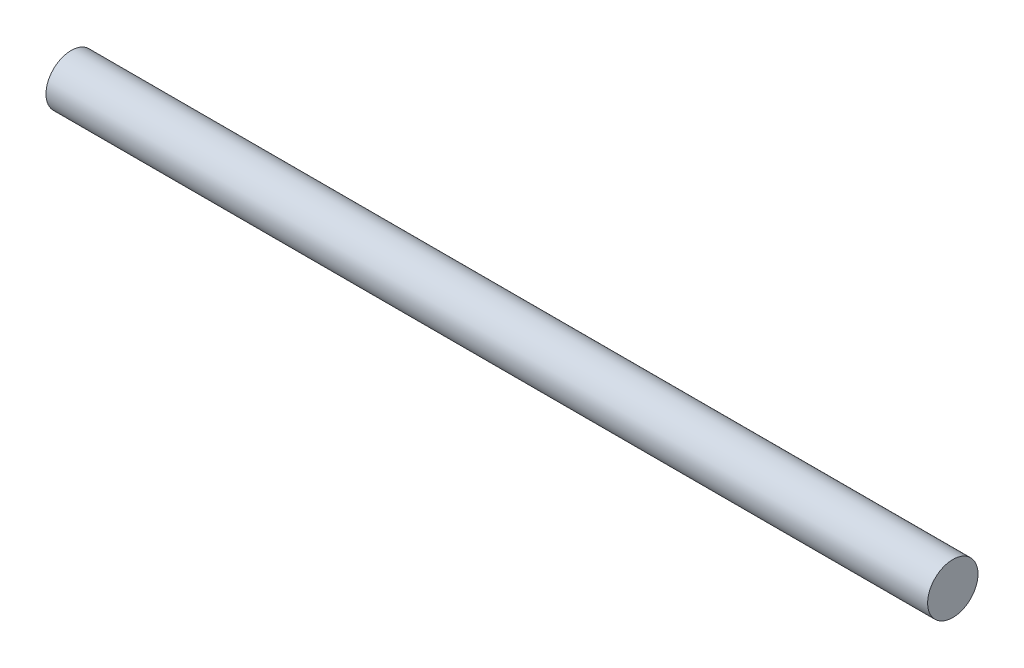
from build123d import *

# Parameters (mm, degrees)
ESQUISSE1_R        = 4
BOSS_EXTRU_1_DEPTH = 70


with BuildPart() as part:
    # Esquisse1 → Boss.-Extru.1 (new, symmetric)
    with BuildSketch(Plane(origin=(0, 0, 0), x_dir=(0, 0, -1), z_dir=(1, 0, 0))):
        Circle(ESQUISSE1_R)
    extrude(amount=BOSS_EXTRU_1_DEPTH, both=True)


solid = part.part
